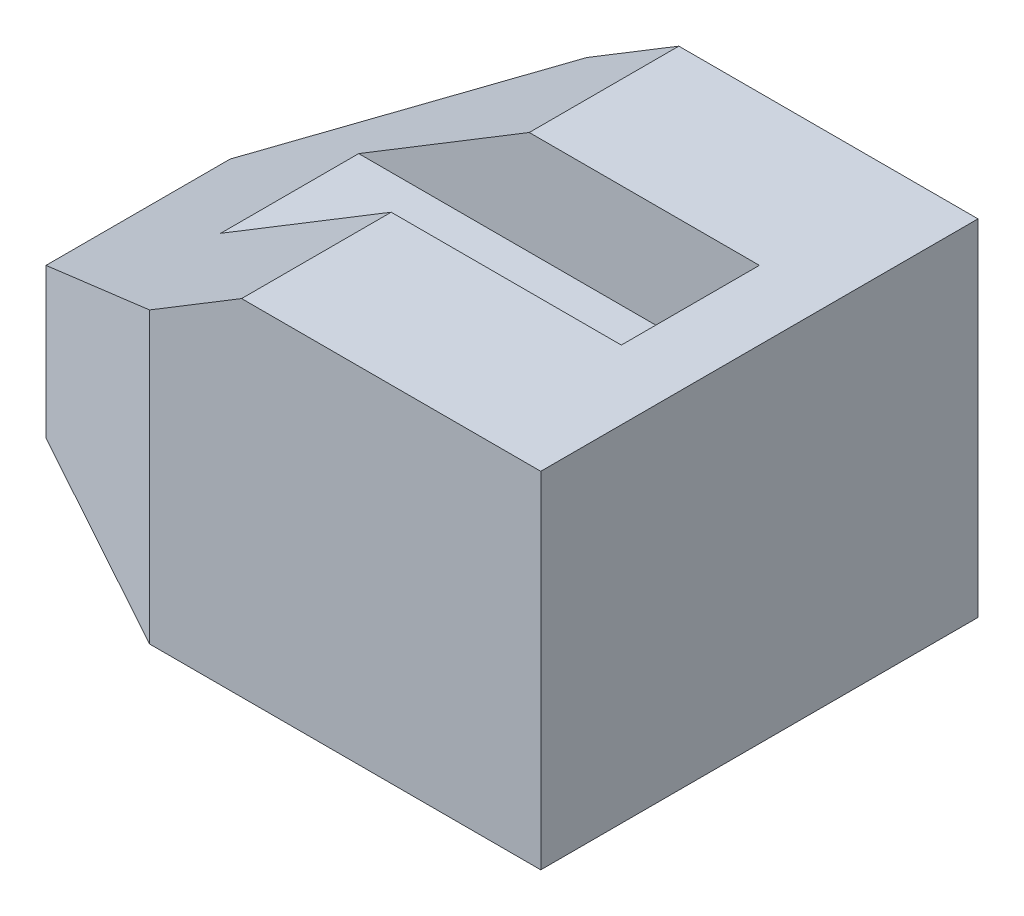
ISO-10303-21;
HEADER;
FILE_DESCRIPTION(('STEP AP214'),'2;1');
FILE_NAME('part.step','',(''),(''),'','','');
FILE_SCHEMA(('AUTOMOTIVE_DESIGN { 1 0 10303 214 1 1 1 1 }'));
ENDSEC;
DATA;
#1=APPLICATION_CONTEXT('core data for automotive mechanical design processes');
#2=APPLICATION_PROTOCOL_DEFINITION('international standard','automotive_design',2000,#1);
#3=PRODUCT_CONTEXT('',#1,'mechanical');
#4=PRODUCT('Part','Part','',(#3));
#5=PRODUCT_RELATED_PRODUCT_CATEGORY('part','',(#4));
#6=PRODUCT_DEFINITION_FORMATION('','',#4);
#7=PRODUCT_DEFINITION_CONTEXT('part definition',#1,'design');
#8=PRODUCT_DEFINITION('design','',#6,#7);
#9=PRODUCT_DEFINITION_SHAPE('','',#8);
#10=(LENGTH_UNIT() NAMED_UNIT(*) SI_UNIT(.MILLI.,.METRE.));
#11=(NAMED_UNIT(*) PLANE_ANGLE_UNIT() SI_UNIT($,.RADIAN.));
#12=(NAMED_UNIT(*) SI_UNIT($,.STERADIAN.) SOLID_ANGLE_UNIT());
#13=UNCERTAINTY_MEASURE_WITH_UNIT(LENGTH_MEASURE(1.E-05),#10,'distance_accuracy_value','');
#14=(GEOMETRIC_REPRESENTATION_CONTEXT(3) GLOBAL_UNCERTAINTY_ASSIGNED_CONTEXT((#13)) GLOBAL_UNIT_ASSIGNED_CONTEXT((#10,
#11,#12)) REPRESENTATION_CONTEXT('',''));
#15=CARTESIAN_POINT('',(0.,0.,0.));
#16=DIRECTION('',(0.,0.,1.));
#17=DIRECTION('',(1.,0.,0.));
#18=AXIS2_PLACEMENT_3D('',#15,#16,#17);
#19=CARTESIAN_POINT('',(0.,13.,19.));
#20=DIRECTION('',(1.,0.,0.));
#21=DIRECTION('',(0.,1.,0.));
#22=AXIS2_PLACEMENT_3D('',#19,#20,#21);
#23=PLANE('',#22);
#24=DIRECTION('',(0.,-1.,0.));
#25=VECTOR('',#24,1.);
#26=CARTESIAN_POINT('',(0.,38.,-8.));
#27=LINE('',#26,#25);
#28=CARTESIAN_POINT('',(0.,13.,-8.));
#29=VERTEX_POINT('',#28);
#30=CARTESIAN_POINT('',(0.,0.,-8.));
#31=VERTEX_POINT('',#30);
#32=EDGE_CURVE('E192',#29,#31,#27,.T.);
#33=ORIENTED_EDGE('',*,*,#32,.T.);
#34=DIRECTION('',(0.,0.,-1.));
#35=VECTOR('',#34,1.);
#36=CARTESIAN_POINT('',(0.,0.,19.));
#37=LINE('',#36,#35);
#38=CARTESIAN_POINT('',(0.,0.,8.));
#39=VERTEX_POINT('',#38);
#40=EDGE_CURVE('E154',#39,#31,#37,.T.);
#41=ORIENTED_EDGE('',*,*,#40,.F.);
#42=DIRECTION('',(0.,-1.,0.));
#43=VECTOR('',#42,1.);
#44=CARTESIAN_POINT('',(0.,38.,8.));
#45=LINE('',#44,#43);
#46=CARTESIAN_POINT('',(0.,13.,8.));
#47=VERTEX_POINT('',#46);
#48=EDGE_CURVE('E170',#47,#39,#45,.T.);
#49=ORIENTED_EDGE('',*,*,#48,.F.);
#50=DIRECTION('',(0.,0.,-1.));
#51=VECTOR('',#50,1.);
#52=CARTESIAN_POINT('',(0.,13.,19.));
#53=LINE('',#52,#51);
#54=EDGE_CURVE('E141',#47,#29,#53,.T.);
#55=ORIENTED_EDGE('',*,*,#54,.T.);
#56=EDGE_LOOP('',(#33,#41,#49,#55));
#57=FACE_BOUND('',#56,.T.);
#58=ADVANCED_FACE('F31',(#57),#23,.F.);
#59=CARTESIAN_POINT('',(0.,0.,19.));
#60=DIRECTION('',(0.,1.,0.));
#61=DIRECTION('',(0.,0.,1.));
#62=AXIS2_PLACEMENT_3D('',#59,#60,#61);
#63=PLANE('',#62);
#64=DIRECTION('',(0.876215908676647,0.,-0.481918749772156));
#65=VECTOR('',#64,1.);
#66=CARTESIAN_POINT('',(20.,0.,-19.));
#67=LINE('',#66,#65);
#68=CARTESIAN_POINT('',(20.,0.,-19.));
#69=VERTEX_POINT('',#68);
#70=EDGE_CURVE('E195',#31,#69,#67,.T.);
#71=ORIENTED_EDGE('',*,*,#70,.T.);
#72=DIRECTION('',(1.,0.,0.));
#73=VECTOR('',#72,1.);
#74=CARTESIAN_POINT('',(0.,0.,-19.));
#75=LINE('',#74,#73);
#76=CARTESIAN_POINT('',(54.,0.,-19.));
#77=VERTEX_POINT('',#76);
#78=EDGE_CURVE('E169',#69,#77,#75,.T.);
#79=ORIENTED_EDGE('',*,*,#78,.T.);
#80=DIRECTION('',(0.,0.,-1.));
#81=VECTOR('',#80,1.);
#82=CARTESIAN_POINT('',(54.,0.,19.));
#83=LINE('',#82,#81);
#84=CARTESIAN_POINT('',(54.,0.,19.));
#85=VERTEX_POINT('',#84);
#86=EDGE_CURVE('E151',#85,#77,#83,.T.);
#87=ORIENTED_EDGE('',*,*,#86,.F.);
#88=DIRECTION('',(1.,0.,0.));
#89=VECTOR('',#88,1.);
#90=CARTESIAN_POINT('',(0.,0.,19.));
#91=LINE('',#90,#89);
#92=CARTESIAN_POINT('',(20.,0.,19.));
#93=VERTEX_POINT('',#92);
#94=EDGE_CURVE('E185',#93,#85,#91,.T.);
#95=ORIENTED_EDGE('',*,*,#94,.F.);
#96=DIRECTION('',(0.876215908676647,0.,0.481918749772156));
#97=VECTOR('',#96,1.);
#98=CARTESIAN_POINT('',(20.,0.,19.));
#99=LINE('',#98,#97);
#100=EDGE_CURVE('E163',#39,#93,#99,.T.);
#101=ORIENTED_EDGE('',*,*,#100,.F.);
#102=ORIENTED_EDGE('',*,*,#40,.T.);
#103=EDGE_LOOP('',(#71,#79,#87,#95,#101,#102));
#104=FACE_BOUND('',#103,.T.);
#105=ADVANCED_FACE('F229',(#104),#63,.F.);
#106=CARTESIAN_POINT('',(28.,30.,19.));
#107=DIRECTION('',(0.518978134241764,-0.854787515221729,0.));
#108=DIRECTION('',(0.854787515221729,0.518978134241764,0.));
#109=AXIS2_PLACEMENT_3D('',#106,#107,#108);
#110=PLANE('',#109);
#111=DIRECTION('',(0.,0.,1.));
#112=VECTOR('',#111,1.);
#113=CARTESIAN_POINT('',(13.1764705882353,21.,-6.));
#114=LINE('',#113,#112);
#115=CARTESIAN_POINT('',(13.1764705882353,21.,-6.));
#116=VERTEX_POINT('',#115);
#117=CARTESIAN_POINT('',(13.1764705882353,21.,6.));
#118=VERTEX_POINT('',#117);
#119=EDGE_CURVE('E132',#116,#118,#114,.T.);
#120=ORIENTED_EDGE('',*,*,#119,.F.);
#121=DIRECTION('',(-0.854787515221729,-0.518978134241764,0.));
#122=VECTOR('',#121,1.);
#123=CARTESIAN_POINT('',(13.1764705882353,21.,-6.));
#124=LINE('',#123,#122);
#125=CARTESIAN_POINT('',(28.,30.,-6.));
#126=VERTEX_POINT('',#125);
#127=EDGE_CURVE('E118',#126,#116,#124,.T.);
#128=ORIENTED_EDGE('',*,*,#127,.F.);
#129=DIRECTION('',(0.,0.,-1.));
#130=VECTOR('',#129,1.);
#131=CARTESIAN_POINT('',(28.,30.,19.));
#132=LINE('',#131,#130);
#133=CARTESIAN_POINT('',(28.,30.,-19.));
#134=VERTEX_POINT('',#133);
#135=EDGE_CURVE('E130',#126,#134,#132,.T.);
#136=ORIENTED_EDGE('',*,*,#135,.T.);
#137=DIRECTION('',(-0.854787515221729,-0.518978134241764,0.));
#138=VECTOR('',#137,1.);
#139=CARTESIAN_POINT('',(28.,30.,-19.));
#140=LINE('',#139,#138);
#141=CARTESIAN_POINT('',(20.,25.1428571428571,-19.));
#142=VERTEX_POINT('',#141);
#143=EDGE_CURVE('E184',#134,#142,#140,.T.);
#144=ORIENTED_EDGE('',*,*,#143,.T.);
#145=DIRECTION('',(0.77356331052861,0.469663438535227,-0.425459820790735));
#146=VECTOR('',#145,1.);
#147=CARTESIAN_POINT('',(14.0453074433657,21.5275080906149,-15.7249190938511));
#148=LINE('',#147,#146);
#149=EDGE_CURVE('E52',#29,#142,#148,.T.);
#150=ORIENTED_EDGE('',*,*,#149,.F.);
#151=ORIENTED_EDGE('',*,*,#54,.F.);
#152=DIRECTION('',(0.77356331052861,0.469663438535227,0.425459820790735));
#153=VECTOR('',#152,1.);
#154=CARTESIAN_POINT('',(26.5518715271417,29.1207791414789,22.6035293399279));
#155=LINE('',#154,#153);
#156=CARTESIAN_POINT('',(20.,25.1428571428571,19.));
#157=VERTEX_POINT('',#156);
#158=EDGE_CURVE('E160',#47,#157,#155,.T.);
#159=ORIENTED_EDGE('',*,*,#158,.T.);
#160=DIRECTION('',(-0.854787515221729,-0.518978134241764,0.));
#161=VECTOR('',#160,1.);
#162=CARTESIAN_POINT('',(28.,30.,19.));
#163=LINE('',#162,#161);
#164=CARTESIAN_POINT('',(28.,30.,19.));
#165=VERTEX_POINT('',#164);
#166=EDGE_CURVE('E146',#165,#157,#163,.T.);
#167=ORIENTED_EDGE('',*,*,#166,.F.);
#168=CARTESIAN_POINT('',(28.,30.,6.));
#169=VERTEX_POINT('',#168);
#170=EDGE_CURVE('E140',#165,#169,#132,.T.);
#171=ORIENTED_EDGE('',*,*,#170,.T.);
#172=DIRECTION('',(-0.854787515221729,-0.518978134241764,0.));
#173=VECTOR('',#172,1.);
#174=CARTESIAN_POINT('',(13.1764705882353,21.,6.));
#175=LINE('',#174,#173);
#176=EDGE_CURVE('E45',#169,#118,#175,.T.);
#177=ORIENTED_EDGE('',*,*,#176,.T.);
#178=EDGE_LOOP('',(#120,#128,#136,#144,#150,#151,#159,#167,#171,#177));
#179=FACE_BOUND('',#178,.T.);
#180=ADVANCED_FACE('F128',(#179),#110,.F.);
#181=CARTESIAN_POINT('',(0.,0.,-19.));
#182=DIRECTION('',(0.,0.,1.));
#183=DIRECTION('',(1.,0.,0.));
#184=AXIS2_PLACEMENT_3D('',#181,#182,#183);
#185=PLANE('',#184);
#186=DIRECTION('',(0.,-1.,0.));
#187=VECTOR('',#186,1.);
#188=CARTESIAN_POINT('',(20.,0.,-19.));
#189=LINE('',#188,#187);
#190=EDGE_CURVE('E11',#142,#69,#189,.T.);
#191=ORIENTED_EDGE('',*,*,#190,.F.);
#192=ORIENTED_EDGE('',*,*,#143,.F.);
#193=DIRECTION('',(-1.,0.,0.));
#194=VECTOR('',#193,1.);
#195=CARTESIAN_POINT('',(54.,30.,-19.));
#196=LINE('',#195,#194);
#197=CARTESIAN_POINT('',(54.,30.,-19.));
#198=VERTEX_POINT('',#197);
#199=EDGE_CURVE('E138',#198,#134,#196,.T.);
#200=ORIENTED_EDGE('',*,*,#199,.F.);
#201=DIRECTION('',(0.,1.,0.));
#202=VECTOR('',#201,1.);
#203=CARTESIAN_POINT('',(54.,0.,-19.));
#204=LINE('',#203,#202);
#205=EDGE_CURVE('E182',#77,#198,#204,.T.);
#206=ORIENTED_EDGE('',*,*,#205,.F.);
#207=ORIENTED_EDGE('',*,*,#78,.F.);
#208=EDGE_LOOP('',(#191,#192,#200,#206,#207));
#209=FACE_BOUND('',#208,.T.);
#210=ADVANCED_FACE('F243',(#209),#185,.F.);
#211=CARTESIAN_POINT('',(54.,0.,19.));
#212=DIRECTION('',(-1.,0.,0.));
#213=DIRECTION('',(0.,0.,1.));
#214=AXIS2_PLACEMENT_3D('',#211,#212,#213);
#215=PLANE('',#214);
#216=ORIENTED_EDGE('',*,*,#205,.T.);
#217=DIRECTION('',(0.,0.,-1.));
#218=VECTOR('',#217,1.);
#219=CARTESIAN_POINT('',(54.,30.,19.));
#220=LINE('',#219,#218);
#221=CARTESIAN_POINT('',(54.,30.,19.));
#222=VERTEX_POINT('',#221);
#223=EDGE_CURVE('E144',#222,#198,#220,.T.);
#224=ORIENTED_EDGE('',*,*,#223,.F.);
#225=DIRECTION('',(0.,1.,0.));
#226=VECTOR('',#225,1.);
#227=CARTESIAN_POINT('',(54.,0.,19.));
#228=LINE('',#227,#226);
#229=EDGE_CURVE('E177',#85,#222,#228,.T.);
#230=ORIENTED_EDGE('',*,*,#229,.F.);
#231=ORIENTED_EDGE('',*,*,#86,.T.);
#232=EDGE_LOOP('',(#216,#224,#230,#231));
#233=FACE_BOUND('',#232,.T.);
#234=ADVANCED_FACE('F241',(#233),#215,.F.);
#235=CARTESIAN_POINT('',(54.,30.,19.));
#236=DIRECTION('',(0.,-1.,0.));
#237=DIRECTION('',(1.,0.,0.));
#238=AXIS2_PLACEMENT_3D('',#235,#236,#237);
#239=PLANE('',#238);
#240=ORIENTED_EDGE('',*,*,#135,.F.);
#241=DIRECTION('',(-1.,0.,0.));
#242=VECTOR('',#241,1.);
#243=CARTESIAN_POINT('',(28.,30.,-6.));
#244=LINE('',#243,#242);
#245=CARTESIAN_POINT('',(48.,30.,-6.));
#246=VERTEX_POINT('',#245);
#247=EDGE_CURVE('E114',#246,#126,#244,.T.);
#248=ORIENTED_EDGE('',*,*,#247,.F.);
#249=DIRECTION('',(0.,0.,1.));
#250=VECTOR('',#249,1.);
#251=CARTESIAN_POINT('',(48.,30.,-6.));
#252=LINE('',#251,#250);
#253=CARTESIAN_POINT('',(48.,30.,6.));
#254=VERTEX_POINT('',#253);
#255=EDGE_CURVE('E198',#246,#254,#252,.T.);
#256=ORIENTED_EDGE('',*,*,#255,.T.);
#257=DIRECTION('',(-1.,0.,0.));
#258=VECTOR('',#257,1.);
#259=CARTESIAN_POINT('',(28.,30.,6.));
#260=LINE('',#259,#258);
#261=EDGE_CURVE('E209',#254,#169,#260,.T.);
#262=ORIENTED_EDGE('',*,*,#261,.T.);
#263=ORIENTED_EDGE('',*,*,#170,.F.);
#264=DIRECTION('',(-1.,0.,0.));
#265=VECTOR('',#264,1.);
#266=CARTESIAN_POINT('',(54.,30.,19.));
#267=LINE('',#266,#265);
#268=EDGE_CURVE('E174',#222,#165,#267,.T.);
#269=ORIENTED_EDGE('',*,*,#268,.F.);
#270=ORIENTED_EDGE('',*,*,#223,.T.);
#271=ORIENTED_EDGE('',*,*,#199,.T.);
#272=EDGE_LOOP('',(#240,#248,#256,#262,#263,#269,#270,#271));
#273=FACE_BOUND('',#272,.T.);
#274=ADVANCED_FACE('F135',(#273),#239,.F.);
#275=CARTESIAN_POINT('',(0.,0.,19.));
#276=DIRECTION('',(0.,0.,1.));
#277=DIRECTION('',(1.,0.,0.));
#278=AXIS2_PLACEMENT_3D('',#275,#276,#277);
#279=PLANE('',#278);
#280=DIRECTION('',(0.,1.,0.));
#281=VECTOR('',#280,1.);
#282=CARTESIAN_POINT('',(20.,0.,19.));
#283=LINE('',#282,#281);
#284=EDGE_CURVE('E38',#93,#157,#283,.T.);
#285=ORIENTED_EDGE('',*,*,#284,.F.);
#286=ORIENTED_EDGE('',*,*,#94,.T.);
#287=ORIENTED_EDGE('',*,*,#229,.T.);
#288=ORIENTED_EDGE('',*,*,#268,.T.);
#289=ORIENTED_EDGE('',*,*,#166,.T.);
#290=EDGE_LOOP('',(#285,#286,#287,#288,#289));
#291=FACE_BOUND('',#290,.T.);
#292=ADVANCED_FACE('F172',(#291),#279,.T.);
#293=CARTESIAN_POINT('',(20.,38.,19.));
#294=DIRECTION('',(0.481918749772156,0.,-0.876215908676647));
#295=DIRECTION('',(-0.876215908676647,0.,-0.481918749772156));
#296=AXIS2_PLACEMENT_3D('',#293,#294,#295);
#297=PLANE('',#296);
#298=ORIENTED_EDGE('',*,*,#48,.T.);
#299=ORIENTED_EDGE('',*,*,#100,.T.);
#300=ORIENTED_EDGE('',*,*,#284,.T.);
#301=ORIENTED_EDGE('',*,*,#158,.F.);
#302=EDGE_LOOP('',(#298,#299,#300,#301));
#303=FACE_BOUND('',#302,.T.);
#304=ADVANCED_FACE('F159',(#303),#297,.F.);
#305=CARTESIAN_POINT('',(20.,38.,-19.));
#306=DIRECTION('',(-0.481918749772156,0.,-0.876215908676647));
#307=DIRECTION('',(-0.876215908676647,0.,0.481918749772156));
#308=AXIS2_PLACEMENT_3D('',#305,#306,#307);
#309=PLANE('',#308);
#310=ORIENTED_EDGE('',*,*,#149,.T.);
#311=ORIENTED_EDGE('',*,*,#190,.T.);
#312=ORIENTED_EDGE('',*,*,#70,.F.);
#313=ORIENTED_EDGE('',*,*,#32,.F.);
#314=EDGE_LOOP('',(#310,#311,#312,#313));
#315=FACE_BOUND('',#314,.T.);
#316=ADVANCED_FACE('F225',(#315),#309,.T.);
#317=CARTESIAN_POINT('',(48.,30.,-6.));
#318=DIRECTION('',(0.768281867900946,-0.640111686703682,0.));
#319=DIRECTION('',(0.640111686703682,0.768281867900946,0.));
#320=AXIS2_PLACEMENT_3D('',#317,#318,#319);
#321=PLANE('',#320);
#322=DIRECTION('',(0.640111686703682,0.768281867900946,0.));
#323=VECTOR('',#322,1.);
#324=CARTESIAN_POINT('',(48.,30.,6.));
#325=LINE('',#324,#323);
#326=CARTESIAN_POINT('',(40.5014432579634,21.,6.));
#327=VERTEX_POINT('',#326);
#328=EDGE_CURVE('E125',#327,#254,#325,.T.);
#329=ORIENTED_EDGE('',*,*,#328,.T.);
#330=ORIENTED_EDGE('',*,*,#255,.F.);
#331=DIRECTION('',(0.640111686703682,0.768281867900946,0.));
#332=VECTOR('',#331,1.);
#333=CARTESIAN_POINT('',(48.,30.,-6.));
#334=LINE('',#333,#332);
#335=CARTESIAN_POINT('',(40.5014432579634,21.,-6.));
#336=VERTEX_POINT('',#335);
#337=EDGE_CURVE('E121',#336,#246,#334,.T.);
#338=ORIENTED_EDGE('',*,*,#337,.F.);
#339=DIRECTION('',(0.,0.,1.));
#340=VECTOR('',#339,1.);
#341=CARTESIAN_POINT('',(40.5014432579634,21.,-6.));
#342=LINE('',#341,#340);
#343=EDGE_CURVE('E200',#336,#327,#342,.T.);
#344=ORIENTED_EDGE('',*,*,#343,.T.);
#345=EDGE_LOOP('',(#329,#330,#338,#344));
#346=FACE_BOUND('',#345,.T.);
#347=ADVANCED_FACE('F214',(#346),#321,.F.);
#348=CARTESIAN_POINT('',(40.5014432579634,21.,-6.));
#349=DIRECTION('',(0.,-1.,0.));
#350=DIRECTION('',(1.,0.,0.));
#351=AXIS2_PLACEMENT_3D('',#348,#349,#350);
#352=PLANE('',#351);
#353=DIRECTION('',(1.,0.,0.));
#354=VECTOR('',#353,1.);
#355=CARTESIAN_POINT('',(40.5014432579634,21.,6.));
#356=LINE('',#355,#354);
#357=EDGE_CURVE('E205',#118,#327,#356,.T.);
#358=ORIENTED_EDGE('',*,*,#357,.T.);
#359=ORIENTED_EDGE('',*,*,#343,.F.);
#360=DIRECTION('',(1.,0.,0.));
#361=VECTOR('',#360,1.);
#362=CARTESIAN_POINT('',(40.5014432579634,21.,-6.));
#363=LINE('',#362,#361);
#364=EDGE_CURVE('E133',#116,#336,#363,.T.);
#365=ORIENTED_EDGE('',*,*,#364,.F.);
#366=ORIENTED_EDGE('',*,*,#119,.T.);
#367=EDGE_LOOP('',(#358,#359,#365,#366));
#368=FACE_BOUND('',#367,.T.);
#369=ADVANCED_FACE('F217',(#368),#352,.F.);
#370=CARTESIAN_POINT('',(48.,30.,-6.));
#371=DIRECTION('',(0.,0.,-1.));
#372=DIRECTION('',(-1.,0.,0.));
#373=AXIS2_PLACEMENT_3D('',#370,#371,#372);
#374=PLANE('',#373);
#375=ORIENTED_EDGE('',*,*,#247,.T.);
#376=ORIENTED_EDGE('',*,*,#127,.T.);
#377=ORIENTED_EDGE('',*,*,#364,.T.);
#378=ORIENTED_EDGE('',*,*,#337,.T.);
#379=EDGE_LOOP('',(#375,#376,#377,#378));
#380=FACE_BOUND('',#379,.T.);
#381=ADVANCED_FACE('F116',(#380),#374,.F.);
#382=CARTESIAN_POINT('',(48.,30.,6.));
#383=DIRECTION('',(0.,0.,-1.));
#384=DIRECTION('',(-1.,0.,0.));
#385=AXIS2_PLACEMENT_3D('',#382,#383,#384);
#386=PLANE('',#385);
#387=ORIENTED_EDGE('',*,*,#261,.F.);
#388=ORIENTED_EDGE('',*,*,#328,.F.);
#389=ORIENTED_EDGE('',*,*,#357,.F.);
#390=ORIENTED_EDGE('',*,*,#176,.F.);
#391=EDGE_LOOP('',(#387,#388,#389,#390));
#392=FACE_BOUND('',#391,.T.);
#393=ADVANCED_FACE('F216',(#392),#386,.T.);
#394=CLOSED_SHELL('',(#58,#105,#180,#210,#234,#274,#292,#304,#316,#347,#369,#381,#393));
#395=MANIFOLD_SOLID_BREP('B2',#394);
#396=ADVANCED_BREP_SHAPE_REPRESENTATION('',(#18,#395),#14);
#397=SHAPE_DEFINITION_REPRESENTATION(#9,#396);
ENDSEC;
END-ISO-10303-21;
